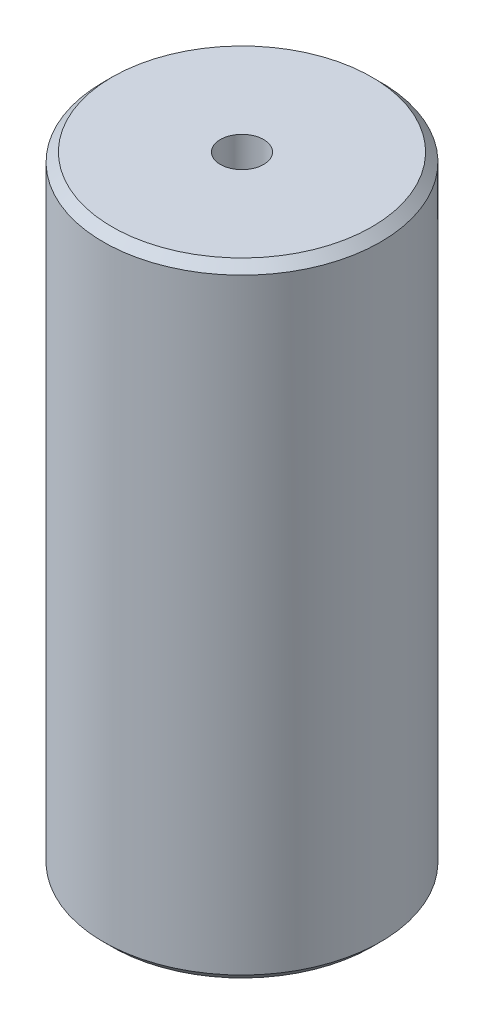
from build123d import *

# Parameters (mm, degrees)
SKETCH1_W     = 25.4
SKETCH1_H     = 114.3
CHAMFER1_SIZE = 1.6002


with BuildPart() as part:
    # Sketch1 → Revolve1 (revolve)
    with BuildSketch(Plane.XY, mode=Mode.PRIVATE) as revolve1_sk:
        with Locations((12.7, 57.15)):
            Rectangle(SKETCH1_W, SKETCH1_H)
    revolve(revolve1_sk.sketch.rotate(Axis((0, 114.3, 0), (0, -1, 0)), 180), axis=Axis((0, 114.3, 0), (0, -1, 0)))

    # Chamfer1
    chamfer1_edges = [part.edges().sort_by_distance(p)[0] for p in [
        (25.4, 0, 0),
        (25.4, 114.3, 0),
    ]]
    chamfer(chamfer1_edges, length=CHAMFER1_SIZE)

    # Sketch2 → 3_8-16 Tapped Hole1 (revolve, cut)
    with BuildSketch(Plane(origin=(0, 0, 0), x_dir=(0, 0, -1), z_dir=(1, 0, 0))):
        Polygon((0, 0), (0, 23.022165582), (3.96875, 20.6375), (3.96875, 0), align=None)
    f_3_8_16_tapped_hole1 = revolve(axis=Axis((0, -6.35, 0), (0, 1, 0)), mode=Mode.SUBTRACT)

    # Mirror2: 3_8-16 Tapped Hole1 across plane
    add(f_3_8_16_tapped_hole1.mirror(Plane.ZX.offset(57.15)), mode=Mode.SUBTRACT)


solid = part.part
